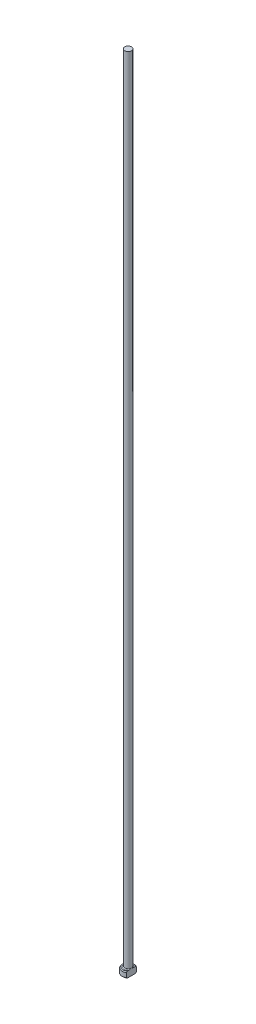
ISO-10303-21;
HEADER;
FILE_DESCRIPTION(('STEP AP214'),'2;1');
FILE_NAME('part.step','',(''),(''),'','','');
FILE_SCHEMA(('AUTOMOTIVE_DESIGN { 1 0 10303 214 1 1 1 1 }'));
ENDSEC;
DATA;
#1=APPLICATION_CONTEXT('core data for automotive mechanical design processes');
#2=APPLICATION_PROTOCOL_DEFINITION('international standard','automotive_design',2000,#1);
#3=PRODUCT_CONTEXT('',#1,'mechanical');
#4=PRODUCT('Part','Part','',(#3));
#5=PRODUCT_RELATED_PRODUCT_CATEGORY('part','',(#4));
#6=PRODUCT_DEFINITION_FORMATION('','',#4);
#7=PRODUCT_DEFINITION_CONTEXT('part definition',#1,'design');
#8=PRODUCT_DEFINITION('design','',#6,#7);
#9=PRODUCT_DEFINITION_SHAPE('','',#8);
#10=(LENGTH_UNIT() NAMED_UNIT(*) SI_UNIT(.MILLI.,.METRE.));
#11=(NAMED_UNIT(*) PLANE_ANGLE_UNIT() SI_UNIT($,.RADIAN.));
#12=(NAMED_UNIT(*) SI_UNIT($,.STERADIAN.) SOLID_ANGLE_UNIT());
#13=UNCERTAINTY_MEASURE_WITH_UNIT(LENGTH_MEASURE(1.E-05),#10,'distance_accuracy_value','');
#14=(GEOMETRIC_REPRESENTATION_CONTEXT(3) GLOBAL_UNCERTAINTY_ASSIGNED_CONTEXT((#13)) GLOBAL_UNIT_ASSIGNED_CONTEXT((#10,
#11,#12)) REPRESENTATION_CONTEXT('',''));
#15=CARTESIAN_POINT('',(0.,0.,0.));
#16=DIRECTION('',(0.,0.,1.));
#17=DIRECTION('',(1.,0.,0.));
#18=AXIS2_PLACEMENT_3D('',#15,#16,#17);
#19=CARTESIAN_POINT('',(0.,0.,0.));
#20=DIRECTION('',(0.,-1.,0.));
#21=DIRECTION('',(0.,0.,-1.));
#22=AXIS2_PLACEMENT_3D('',#19,#20,#21);
#23=PLANE('',#22);
#24=CARTESIAN_POINT('',(0.,0.,0.));
#25=DIRECTION('',(0.,-1.,0.));
#26=DIRECTION('',(0.,0.,-1.));
#27=AXIS2_PLACEMENT_3D('',#24,#25,#26);
#28=CIRCLE('',#27,1.29999999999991);
#29=CARTESIAN_POINT('',(0.849999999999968,0.,0.983615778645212));
#30=VERTEX_POINT('',#29);
#31=CARTESIAN_POINT('',(0.849999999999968,0.,-0.983615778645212));
#32=VERTEX_POINT('',#31);
#33=EDGE_CURVE('E98',#30,#32,#28,.T.);
#34=ORIENTED_EDGE('',*,*,#33,.T.);
#35=DIRECTION('',(0.,0.,1.));
#36=VECTOR('',#35,1.);
#37=CARTESIAN_POINT('',(0.849999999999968,0.,-1.23592070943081));
#38=LINE('',#37,#36);
#39=EDGE_CURVE('E83',#32,#30,#38,.T.);
#40=ORIENTED_EDGE('',*,*,#39,.T.);
#41=EDGE_LOOP('',(#34,#40));
#42=FACE_BOUND('',#41,.T.);
#43=ADVANCED_FACE('F32',(#42),#23,.T.);
#44=CARTESIAN_POINT('',(0.,259.958771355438,0.));
#45=DIRECTION('',(0.,1.,0.));
#46=DIRECTION('',(0.,0.,1.));
#47=AXIS2_PLACEMENT_3D('',#44,#45,#46);
#48=CYLINDRICAL_SURFACE('',#47,1.49999999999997);
#49=CARTESIAN_POINT('',(0.,1.30000000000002,0.));
#50=DIRECTION('',(0.,1.,0.));
#51=DIRECTION('',(0.,0.,1.));
#52=AXIS2_PLACEMENT_3D('',#49,#50,#51);
#53=CIRCLE('',#52,1.49999999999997);
#54=CARTESIAN_POINT('',(0.849999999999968,1.30000000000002,1.23592070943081));
#55=VERTEX_POINT('',#54);
#56=CARTESIAN_POINT('',(0.849999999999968,1.30000000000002,-1.23592070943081));
#57=VERTEX_POINT('',#56);
#58=EDGE_CURVE('E104',#55,#57,#53,.F.);
#59=ORIENTED_EDGE('',*,*,#58,.T.);
#60=DIRECTION('',(0.,-1.,0.));
#61=VECTOR('',#60,1.);
#62=CARTESIAN_POINT('',(0.849999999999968,200.,-1.23592070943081));
#63=LINE('',#62,#61);
#64=CARTESIAN_POINT('',(0.849999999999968,0.200000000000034,-1.23592070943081));
#65=VERTEX_POINT('',#64);
#66=EDGE_CURVE('E183',#57,#65,#63,.T.);
#67=ORIENTED_EDGE('',*,*,#66,.T.);
#68=CARTESIAN_POINT('',(0.,0.200000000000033,0.));
#69=DIRECTION('',(0.,-1.,0.));
#70=DIRECTION('',(0.,0.,-1.));
#71=AXIS2_PLACEMENT_3D('',#68,#69,#70);
#72=CIRCLE('',#71,1.49999999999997);
#73=CARTESIAN_POINT('',(0.849999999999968,0.200000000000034,1.23592070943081));
#74=VERTEX_POINT('',#73);
#75=EDGE_CURVE('E100',#65,#74,#72,.F.);
#76=ORIENTED_EDGE('',*,*,#75,.T.);
#77=DIRECTION('',(0.,-1.,0.));
#78=VECTOR('',#77,1.);
#79=CARTESIAN_POINT('',(0.849999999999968,200.,1.23592070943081));
#80=LINE('',#79,#78);
#81=EDGE_CURVE('E93',#55,#74,#80,.T.);
#82=ORIENTED_EDGE('',*,*,#81,.F.);
#83=EDGE_LOOP('',(#59,#67,#76,#82));
#84=FACE_BOUND('',#83,.T.);
#85=ADVANCED_FACE('F158',(#84),#48,.T.);
#86=CARTESIAN_POINT('',(-1.49999999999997,1.5,0.));
#87=DIRECTION('',(0.,1.,0.));
#88=DIRECTION('',(0.,0.,1.));
#89=AXIS2_PLACEMENT_3D('',#86,#87,#88);
#90=PLANE('',#89);
#91=CARTESIAN_POINT('',(0.,1.5,0.));
#92=DIRECTION('',(0.,1.,0.));
#93=DIRECTION('',(0.,0.,1.));
#94=AXIS2_PLACEMENT_3D('',#91,#92,#93);
#95=CIRCLE('',#94,1.30000000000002);
#96=CARTESIAN_POINT('',(0.849999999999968,1.5,-0.98361577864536));
#97=VERTEX_POINT('',#96);
#98=CARTESIAN_POINT('',(0.849999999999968,1.5,0.98361577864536));
#99=VERTEX_POINT('',#98);
#100=EDGE_CURVE('E178',#97,#99,#95,.T.);
#101=ORIENTED_EDGE('',*,*,#100,.T.);
#102=DIRECTION('',(0.,0.,-1.));
#103=VECTOR('',#102,1.);
#104=CARTESIAN_POINT('',(0.849999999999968,1.5,0.));
#105=LINE('',#104,#103);
#106=CARTESIAN_POINT('',(0.849999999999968,1.49999999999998,0.616441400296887));
#107=VERTEX_POINT('',#106);
#108=EDGE_CURVE('E57',#99,#107,#105,.T.);
#109=ORIENTED_EDGE('',*,*,#108,.T.);
#110=CARTESIAN_POINT('',(0.,1.5,0.));
#111=DIRECTION('',(0.,1.,0.));
#112=DIRECTION('',(0.,0.,1.));
#113=AXIS2_PLACEMENT_3D('',#110,#111,#112);
#114=CIRCLE('',#113,1.04999999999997);
#115=CARTESIAN_POINT('',(0.849999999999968,1.49999999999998,-0.616441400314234));
#116=VERTEX_POINT('',#115);
#117=EDGE_CURVE('E107',#107,#116,#114,.F.);
#118=ORIENTED_EDGE('',*,*,#117,.T.);
#119=EDGE_CURVE('E136',#116,#97,#105,.T.);
#120=ORIENTED_EDGE('',*,*,#119,.T.);
#121=EDGE_LOOP('',(#101,#109,#118,#120));
#122=FACE_BOUND('',#121,.T.);
#123=ADVANCED_FACE('F147',(#122),#90,.T.);
#124=CARTESIAN_POINT('',(0.,1.5,0.));
#125=DIRECTION('',(0.,-1.,0.));
#126=DIRECTION('',(0.,0.,-1.));
#127=AXIS2_PLACEMENT_3D('',#124,#125,#126);
#128=CONICAL_SURFACE('',#127,1.30000000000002,0.785398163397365);
#129=ORIENTED_EDGE('',*,*,#58,.F.);
#130=CARTESIAN_POINT('',(0.849999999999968,-0.0536064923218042,2.72407232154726));
#131=CARTESIAN_POINT('',(0.849999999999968,0.039914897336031,2.62606654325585));
#132=CARTESIAN_POINT('',(0.849999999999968,0.133238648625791,2.52786853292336));
#133=CARTESIAN_POINT('',(0.849999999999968,0.31925113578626,2.33082073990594));
#134=CARTESIAN_POINT('',(0.849999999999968,0.411939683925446,2.23197078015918));
#135=CARTESIAN_POINT('',(0.849999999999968,0.597160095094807,2.03257664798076));
#136=CARTESIAN_POINT('',(0.849999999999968,0.689684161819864,1.93202522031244));
#137=CARTESIAN_POINT('',(0.849999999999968,0.873277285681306,1.72962471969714));
#138=CARTESIAN_POINT('',(0.849999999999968,0.964346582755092,1.62777586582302));
#139=CARTESIAN_POINT('',(0.849999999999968,1.10955880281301,1.46151679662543));
#140=CARTESIAN_POINT('',(0.849999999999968,1.16444529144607,1.39775756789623));
#141=CARTESIAN_POINT('',(0.849999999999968,1.27292840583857,1.26911422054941));
#142=CARTESIAN_POINT('',(0.849999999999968,1.32652466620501,1.20422979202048));
#143=CARTESIAN_POINT('',(0.849999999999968,1.43166568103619,1.07302339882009));
#144=CARTESIAN_POINT('',(0.849999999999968,1.48321432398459,1.00670456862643));
#145=CARTESIAN_POINT('',(0.849999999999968,1.58324559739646,0.87181221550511));
#146=CARTESIAN_POINT('',(0.849999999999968,1.63173001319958,0.803240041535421));
#147=CARTESIAN_POINT('',(0.849999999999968,1.71576170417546,0.674554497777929));
#148=CARTESIAN_POINT('',(0.849999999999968,1.75211002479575,0.614972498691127));
#149=CARTESIAN_POINT('',(0.849999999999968,1.81898270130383,0.492486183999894));
#150=CARTESIAN_POINT('',(0.849999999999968,1.84950605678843,0.42958130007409));
#151=CARTESIAN_POINT('',(0.849999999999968,1.89525543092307,0.313443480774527));
#152=CARTESIAN_POINT('',(0.849999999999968,1.91235250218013,0.260986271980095));
#153=CARTESIAN_POINT('',(0.849999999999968,1.93136611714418,0.180826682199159));
#154=CARTESIAN_POINT('',(0.849999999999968,1.93659539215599,0.153907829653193));
#155=CARTESIAN_POINT('',(0.849999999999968,1.94459007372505,0.099712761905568));
#156=CARTESIAN_POINT('',(0.849999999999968,1.94735676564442,0.0724367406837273));
#157=CARTESIAN_POINT('',(0.849999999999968,1.95026529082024,0.0175115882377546));
#158=CARTESIAN_POINT('',(0.849999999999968,1.95038485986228,-0.0101387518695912));
#159=CARTESIAN_POINT('',(0.849999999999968,1.94794150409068,-0.0653143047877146));
#160=CARTESIAN_POINT('',(0.849999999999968,1.94537851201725,-0.0928395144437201));
#161=CARTESIAN_POINT('',(0.849999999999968,1.93385723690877,-0.17503084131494));
#162=CARTESIAN_POINT('',(0.849999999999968,1.92106065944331,-0.229178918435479));
#163=CARTESIAN_POINT('',(0.849999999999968,1.89152127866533,-0.323067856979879));
#164=CARTESIAN_POINT('',(0.849999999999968,1.87629794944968,-0.363325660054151));
#165=CARTESIAN_POINT('',(0.849999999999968,1.84242832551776,-0.44239812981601));
#166=CARTESIAN_POINT('',(0.849999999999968,1.82377936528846,-0.481211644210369));
#167=CARTESIAN_POINT('',(0.849999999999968,1.78377495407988,-0.557941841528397));
#168=CARTESIAN_POINT('',(0.849999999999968,1.76239176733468,-0.595843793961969));
#169=CARTESIAN_POINT('',(0.849999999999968,1.71778219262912,-0.670514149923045));
#170=CARTESIAN_POINT('',(0.849999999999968,1.69455659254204,-0.707283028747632));
#171=CARTESIAN_POINT('',(0.849999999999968,1.63863584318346,-0.792218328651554));
#172=CARTESIAN_POINT('',(0.849999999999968,1.60539843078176,-0.840025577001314));
#173=CARTESIAN_POINT('',(0.849999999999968,1.53723101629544,-0.93442364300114));
#174=CARTESIAN_POINT('',(0.849999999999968,1.50230057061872,-0.98101413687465));
#175=CARTESIAN_POINT('',(0.849999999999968,1.43120159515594,-1.07330100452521));
#176=CARTESIAN_POINT('',(0.849999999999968,1.39503201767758,-1.11899656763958));
#177=CARTESIAN_POINT('',(0.849999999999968,1.32179772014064,-1.20966630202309));
#178=CARTESIAN_POINT('',(0.849999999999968,1.2847329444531,-1.25464042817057));
#179=CARTESIAN_POINT('',(0.849999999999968,1.17226420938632,-1.38904939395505));
#180=CARTESIAN_POINT('',(0.849999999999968,1.09584896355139,-1.47763652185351));
#181=CARTESIAN_POINT('',(0.849999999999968,0.941436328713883,-1.6533275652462));
#182=CARTESIAN_POINT('',(0.849999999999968,0.863439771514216,-1.74043221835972));
#183=CARTESIAN_POINT('',(0.849999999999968,0.715932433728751,-1.90311943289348));
#184=CARTESIAN_POINT('',(0.849999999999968,0.646544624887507,-1.97881368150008));
#185=CARTESIAN_POINT('',(0.849999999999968,0.507159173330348,-2.12965926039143));
#186=CARTESIAN_POINT('',(0.849999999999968,0.437161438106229,-2.20481050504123));
#187=CARTESIAN_POINT('',(0.849999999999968,0.29721774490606,-2.35416590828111));
#188=CARTESIAN_POINT('',(0.849999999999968,0.227274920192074,-2.42837300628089));
#189=CARTESIAN_POINT('',(0.849999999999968,0.0870600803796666,-2.57645011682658));
#190=CARTESIAN_POINT('',(0.849999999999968,0.0167881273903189,-2.65032018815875));
#191=CARTESIAN_POINT('',(0.849999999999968,-0.0536064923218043,-2.72407232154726));
#192=B_SPLINE_CURVE_WITH_KNOTS('',3,(#130,#131,#132,#133,#134,#135,#136,#137,#138,#139,#140,
#141,#142,#143,#144,#145,#146,#147,#148,#149,#150,#151,#152,#153,#154,#155,#156,#157,#158,#159,
#160,#161,#162,#163,#164,#165,#166,#167,#168,#169,#170,#171,#172,#173,#174,#175,#176,#177,#178,
#179,#180,#181,#182,#183,#184,#185,#186,#187,#188,#189,#190,#191),.UNSPECIFIED.,.F.,.F.,(4,2,2,
2,2,2,2,2,2,2,2,2,2,2,2,2,2,2,2,2,2,2,2,2,2,2,2,2,2,2,4),(0.,0.406405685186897,
0.812926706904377,1.22284825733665,1.63270148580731,1.88507867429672,2.13752651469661,
2.3894694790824,2.64126427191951,2.8504643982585,3.05970042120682,3.22459093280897,
3.30675945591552,3.38888506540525,3.47170115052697,3.55451931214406,3.72055062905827,
3.84950358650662,3.97855731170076,4.10904305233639,4.23947329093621,4.4140945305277,
4.58876177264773,4.76358052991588,4.93841017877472,5.28934513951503,5.64010005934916,
5.94815166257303,6.25625083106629,6.56217157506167,6.86803674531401),.UNSPECIFIED.);
#193=EDGE_CURVE('E135',#55,#99,#192,.T.);
#194=ORIENTED_EDGE('',*,*,#193,.T.);
#195=ORIENTED_EDGE('',*,*,#100,.F.);
#196=EDGE_CURVE('E127',#97,#57,#192,.T.);
#197=ORIENTED_EDGE('',*,*,#196,.T.);
#198=EDGE_LOOP('',(#129,#194,#195,#197));
#199=FACE_BOUND('',#198,.T.);
#200=ADVANCED_FACE('F143',(#199),#128,.T.);
#201=CARTESIAN_POINT('',(0.,0.200000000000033,0.));
#202=DIRECTION('',(0.,1.,0.));
#203=DIRECTION('',(0.,0.,1.));
#204=AXIS2_PLACEMENT_3D('',#201,#202,#203);
#205=CONICAL_SURFACE('',#204,1.49999999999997,0.785398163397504);
#206=ORIENTED_EDGE('',*,*,#75,.F.);
#207=CARTESIAN_POINT('',(0.849999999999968,1.55360649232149,-2.72407232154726));
#208=CARTESIAN_POINT('',(0.849999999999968,1.46008510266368,-2.62606654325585));
#209=CARTESIAN_POINT('',(0.849999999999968,1.36676135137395,-2.52786853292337));
#210=CARTESIAN_POINT('',(0.849999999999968,1.18074886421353,-2.33082073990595));
#211=CARTESIAN_POINT('',(0.849999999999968,1.08806031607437,-2.23197078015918));
#212=CARTESIAN_POINT('',(0.849999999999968,0.902839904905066,-2.03257664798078));
#213=CARTESIAN_POINT('',(0.849999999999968,0.810315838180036,-1.93202522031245));
#214=CARTESIAN_POINT('',(0.849999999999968,0.626722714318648,-1.72962471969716));
#215=CARTESIAN_POINT('',(0.849999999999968,0.535653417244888,-1.62777586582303));
#216=CARTESIAN_POINT('',(0.849999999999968,0.390441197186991,-1.46151679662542));
#217=CARTESIAN_POINT('',(0.849999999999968,0.33555470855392,-1.3977575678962));
#218=CARTESIAN_POINT('',(0.849999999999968,0.227071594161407,-1.26911422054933));
#219=CARTESIAN_POINT('',(0.849999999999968,0.17347533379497,-1.20422979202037));
#220=CARTESIAN_POINT('',(0.849999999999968,0.0683343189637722,-1.07302339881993));
#221=CARTESIAN_POINT('',(0.849999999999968,0.0167856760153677,-1.00670456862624));
#222=CARTESIAN_POINT('',(0.849999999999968,-0.0832455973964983,-0.871812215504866));
#223=CARTESIAN_POINT('',(0.849999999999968,-0.131730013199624,-0.803240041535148));
#224=CARTESIAN_POINT('',(0.849999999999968,-0.215761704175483,-0.674554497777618));
#225=CARTESIAN_POINT('',(0.849999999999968,-0.252110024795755,-0.614972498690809));
#226=CARTESIAN_POINT('',(0.849999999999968,-0.318982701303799,-0.492486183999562));
#227=CARTESIAN_POINT('',(0.849999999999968,-0.349506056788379,-0.42958130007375));
#228=CARTESIAN_POINT('',(0.849999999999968,-0.395255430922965,-0.313443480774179));
#229=CARTESIAN_POINT('',(0.849999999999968,-0.412352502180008,-0.260986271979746));
#230=CARTESIAN_POINT('',(0.849999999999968,-0.431366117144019,-0.180826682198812));
#231=CARTESIAN_POINT('',(0.849999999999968,-0.436595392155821,-0.153907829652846));
#232=CARTESIAN_POINT('',(0.849999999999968,-0.444590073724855,-0.0997127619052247));
#233=CARTESIAN_POINT('',(0.849999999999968,-0.447356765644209,-0.072436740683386));
#234=CARTESIAN_POINT('',(0.849999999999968,-0.450265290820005,-0.0175115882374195));
#235=CARTESIAN_POINT('',(0.849999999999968,-0.450384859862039,0.0101387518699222));
#236=CARTESIAN_POINT('',(0.849999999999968,-0.44794150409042,0.0653143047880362));
#237=CARTESIAN_POINT('',(0.849999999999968,-0.445378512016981,0.0928395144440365));
#238=CARTESIAN_POINT('',(0.849999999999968,-0.433857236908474,0.175030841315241));
#239=CARTESIAN_POINT('',(0.849999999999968,-0.421060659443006,0.229178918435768));
#240=CARTESIAN_POINT('',(0.849999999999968,-0.391521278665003,0.323067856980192));
#241=CARTESIAN_POINT('',(0.849999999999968,-0.37629794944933,0.363325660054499));
#242=CARTESIAN_POINT('',(0.849999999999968,-0.342428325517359,0.442398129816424));
#243=CARTESIAN_POINT('',(0.849999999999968,-0.323779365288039,0.481211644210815));
#244=CARTESIAN_POINT('',(0.849999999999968,-0.283774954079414,0.557941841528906));
#245=CARTESIAN_POINT('',(0.849999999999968,-0.262391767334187,0.595843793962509));
#246=CARTESIAN_POINT('',(0.849999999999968,-0.217782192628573,0.670514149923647));
#247=CARTESIAN_POINT('',(0.849999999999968,-0.194556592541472,0.707283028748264));
#248=CARTESIAN_POINT('',(0.849999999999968,-0.138635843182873,0.792218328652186));
#249=CARTESIAN_POINT('',(0.849999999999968,-0.105398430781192,0.840025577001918));
#250=CARTESIAN_POINT('',(0.849999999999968,-0.0372310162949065,0.934423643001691));
#251=CARTESIAN_POINT('',(0.849999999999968,-0.00230057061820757,0.981014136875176));
#252=CARTESIAN_POINT('',(0.849999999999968,0.0687984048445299,1.07330100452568));
#253=CARTESIAN_POINT('',(0.849999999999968,0.104967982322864,1.11899656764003));
#254=CARTESIAN_POINT('',(0.849999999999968,0.178202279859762,1.2096663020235));
#255=CARTESIAN_POINT('',(0.849999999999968,0.215267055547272,1.25464042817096));
#256=CARTESIAN_POINT('',(0.849999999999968,0.327735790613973,1.38904939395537));
#257=CARTESIAN_POINT('',(0.849999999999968,0.404151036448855,1.47763652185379));
#258=CARTESIAN_POINT('',(0.849999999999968,0.558563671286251,1.6533275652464));
#259=CARTESIAN_POINT('',(0.849999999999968,0.636560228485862,1.74043221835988));
#260=CARTESIAN_POINT('',(0.849999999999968,0.784067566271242,1.90311943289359));
#261=CARTESIAN_POINT('',(0.849999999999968,0.853455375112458,1.97881368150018));
#262=CARTESIAN_POINT('',(0.849999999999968,0.992840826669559,2.12965926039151));
#263=CARTESIAN_POINT('',(0.849999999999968,1.06283856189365,2.20481050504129));
#264=CARTESIAN_POINT('',(0.849999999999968,1.20278225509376,2.35416590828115));
#265=CARTESIAN_POINT('',(0.849999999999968,1.27272507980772,2.42837300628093));
#266=CARTESIAN_POINT('',(0.849999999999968,1.41293991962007,2.5764501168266));
#267=CARTESIAN_POINT('',(0.849999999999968,1.48321187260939,2.65032018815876));
#268=CARTESIAN_POINT('',(0.849999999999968,1.55360649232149,2.72407232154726));
#269=B_SPLINE_CURVE_WITH_KNOTS('',3,(#207,#208,#209,#210,#211,#212,#213,#214,#215,#216,#217,
#218,#219,#220,#221,#222,#223,#224,#225,#226,#227,#228,#229,#230,#231,#232,#233,#234,#235,#236,
#237,#238,#239,#240,#241,#242,#243,#244,#245,#246,#247,#248,#249,#250,#251,#252,#253,#254,#255,
#256,#257,#258,#259,#260,#261,#262,#263,#264,#265,#266,#267,#268),.UNSPECIFIED.,.F.,.F.,(4,2,2,
2,2,2,2,2,2,2,2,2,2,2,2,2,2,2,2,2,2,2,2,2,2,2,2,2,2,2,4),(0.,0.406405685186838,
0.812926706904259,1.22284825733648,1.63270148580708,1.88507867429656,2.13752651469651,
2.38946947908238,2.64126427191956,2.85046439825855,3.05970042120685,3.22459093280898,
3.30675945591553,3.38888506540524,3.47170115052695,3.55451931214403,3.72055062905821,
3.84950358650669,3.97855731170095,4.10904305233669,4.23947329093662,4.41409453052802,
4.58876177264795,4.76358052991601,4.93841017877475,5.28934513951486,5.64010005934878,
5.94815166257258,6.25625083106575,6.56217157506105,6.86803674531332),.UNSPECIFIED.);
#270=EDGE_CURVE('E86',#65,#32,#269,.T.);
#271=ORIENTED_EDGE('',*,*,#270,.T.);
#272=ORIENTED_EDGE('',*,*,#33,.F.);
#273=EDGE_CURVE('E89',#30,#74,#269,.T.);
#274=ORIENTED_EDGE('',*,*,#273,.T.);
#275=EDGE_LOOP('',(#206,#271,#272,#274));
#276=FACE_BOUND('',#275,.T.);
#277=ADVANCED_FACE('F97',(#276),#205,.T.);
#278=CARTESIAN_POINT('',(0.,1.69999999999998,0.));
#279=DIRECTION('',(0.,1.,0.));
#280=DIRECTION('',(0.,0.,1.));
#281=AXIS2_PLACEMENT_3D('',#278,#279,#280);
#282=TOROIDAL_SURFACE('',#281,1.04999999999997,0.2);
#283=CARTESIAN_POINT('',(0.849999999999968,1.69999999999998,0.));
#284=CARTESIAN_POINT('',(0.849999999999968,1.70000051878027,-9.40181058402E-12));
#285=CARTESIAN_POINT('',(0.849999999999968,1.70000103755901,-8.53981725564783E-08));
#286=CARTESIAN_POINT('',(0.849999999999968,1.70000204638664,-3.68295676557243E-07));
#287=CARTESIAN_POINT('',(0.849999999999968,1.70000253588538,-5.67473109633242E-07));
#288=CARTESIAN_POINT('',(0.849999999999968,1.70000350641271,-1.05059094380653E-06));
#289=CARTESIAN_POINT('',(0.849999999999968,1.70000398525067,-1.33882692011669E-06));
#290=CARTESIAN_POINT('',(0.849999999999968,1.7000049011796,-1.96944630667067E-06));
#291=CARTESIAN_POINT('',(0.849999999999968,1.70000533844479,-2.31158620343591E-06));
#292=CARTESIAN_POINT('',(0.849999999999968,1.70000675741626,-3.51016254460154E-06));
#293=CARTESIAN_POINT('',(0.849999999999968,1.70000767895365,-4.43847621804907E-06));
#294=CARTESIAN_POINT('',(0.849999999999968,1.70000936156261,-6.38697155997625E-06));
#295=CARTESIAN_POINT('',(0.849999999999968,1.7000101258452,-7.40454028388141E-06));
#296=CARTESIAN_POINT('',(0.849999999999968,1.70001287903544,-1.12525915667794E-05));
#297=CARTESIAN_POINT('',(0.849999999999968,1.70001471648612,-1.41948048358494E-05));
#298=CARTESIAN_POINT('',(0.849999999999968,1.70001783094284,-2.00941117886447E-05));
#299=CARTESIAN_POINT('',(0.849999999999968,1.7000191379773,-2.30360250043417E-05));
#300=CARTESIAN_POINT('',(0.849999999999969,1.700024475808,-3.52043664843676E-05));
#301=CARTESIAN_POINT('',(0.849999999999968,1.70002838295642,-4.4479803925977E-05));
#302=CARTESIAN_POINT('',(0.849999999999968,1.70003486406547,-6.20583674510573E-05));
#303=CARTESIAN_POINT('',(0.849999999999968,1.70003754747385,-7.03197985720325E-05));
#304=CARTESIAN_POINT('',(0.849999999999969,1.70005819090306,-0.000128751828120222));
#305=CARTESIAN_POINT('',(0.849999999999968,1.70008371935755,-0.000175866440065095));
#306=CARTESIAN_POINT('',(0.849999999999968,1.70017804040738,-0.000356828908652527));
#307=CARTESIAN_POINT('',(0.849999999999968,1.70024121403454,-0.000492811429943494));
#308=CARTESIAN_POINT('',(0.849999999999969,1.70048655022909,-0.00101279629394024));
#309=CARTESIAN_POINT('',(0.849999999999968,1.70067459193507,-0.0013945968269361));
#310=CARTESIAN_POINT('',(0.849999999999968,1.7014276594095,-0.00293145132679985));
#311=CARTESIAN_POINT('',(0.849999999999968,1.70198609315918,-0.0040889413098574));
#312=CARTESIAN_POINT('',(0.849999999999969,1.71043533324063,-0.0215925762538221));
#313=CARTESIAN_POINT('',(0.849999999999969,1.71837727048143,-0.0379203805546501));
#314=CARTESIAN_POINT('',(0.849999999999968,1.7338686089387,-0.0700737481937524));
#315=CARTESIAN_POINT('',(0.849999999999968,1.74142215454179,-0.0858974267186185));
#316=CARTESIAN_POINT('',(0.849999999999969,1.75718253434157,-0.119339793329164));
#317=CARTESIAN_POINT('',(0.849999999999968,1.76537140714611,-0.136967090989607));
#318=CARTESIAN_POINT('',(0.849999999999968,1.78150993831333,-0.172531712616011));
#319=CARTESIAN_POINT('',(0.849999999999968,1.78945661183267,-0.190470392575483));
#320=CARTESIAN_POINT('',(0.849999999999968,1.80890508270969,-0.23585761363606));
#321=CARTESIAN_POINT('',(0.849999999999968,1.8201219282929,-0.263430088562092));
#322=CARTESIAN_POINT('',(0.849999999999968,1.84085119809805,-0.31855841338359));
#323=CARTESIAN_POINT('',(0.849999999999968,1.85039454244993,-0.346102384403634));
#324=CARTESIAN_POINT('',(0.849999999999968,1.86376741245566,-0.389594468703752));
#325=CARTESIAN_POINT('',(0.849999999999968,1.86826823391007,-0.405334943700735));
#326=CARTESIAN_POINT('',(0.849999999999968,1.87655535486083,-0.437077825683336));
#327=CARTESIAN_POINT('',(0.849999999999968,1.8803382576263,-0.453081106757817));
#328=CARTESIAN_POINT('',(0.849999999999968,1.8907100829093,-0.502906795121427));
#329=CARTESIAN_POINT('',(0.849999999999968,1.89584064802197,-0.537068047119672));
#330=CARTESIAN_POINT('',(0.849999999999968,1.90023986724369,-0.59774723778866));
#331=CARTESIAN_POINT('',(0.849999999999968,1.90059986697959,-0.624181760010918));
#332=CARTESIAN_POINT('',(0.849999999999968,1.89734237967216,-0.676523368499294));
#333=CARTESIAN_POINT('',(0.849999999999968,1.89377863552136,-0.702432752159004));
#334=CARTESIAN_POINT('',(0.849999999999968,1.88404638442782,-0.743149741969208));
#335=CARTESIAN_POINT('',(0.849999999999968,1.87944517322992,-0.758330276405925));
#336=CARTESIAN_POINT('',(0.849999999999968,1.86810073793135,-0.787921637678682));
#337=CARTESIAN_POINT('',(0.849999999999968,1.86135499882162,-0.802331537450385));
#338=CARTESIAN_POINT('',(0.849999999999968,1.84721190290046,-0.826746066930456));
#339=CARTESIAN_POINT('',(0.849999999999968,1.84028561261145,-0.837021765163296));
#340=CARTESIAN_POINT('',(0.849999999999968,1.82488560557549,-0.856339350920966));
#341=CARTESIAN_POINT('',(0.849999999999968,1.8164148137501,-0.86538351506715));
#342=CARTESIAN_POINT('',(0.849999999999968,1.79993436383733,-0.879978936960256));
#343=CARTESIAN_POINT('',(0.849999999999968,1.79222027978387,-0.885862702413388));
#344=CARTESIAN_POINT('',(0.849999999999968,1.77592760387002,-0.896293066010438));
#345=CARTESIAN_POINT('',(0.849999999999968,1.76734935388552,-0.900840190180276));
#346=CARTESIAN_POINT('',(0.849999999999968,1.74943887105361,-0.908347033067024));
#347=CARTESIAN_POINT('',(0.849999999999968,1.74010143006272,-0.911294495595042));
#348=CARTESIAN_POINT('',(0.849999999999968,1.7210315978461,-0.91532157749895));
#349=CARTESIAN_POINT('',(0.849999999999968,1.71129950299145,-0.916402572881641));
#350=CARTESIAN_POINT('',(0.849999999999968,1.69303591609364,-0.916598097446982));
#351=CARTESIAN_POINT('',(0.849999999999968,1.68450611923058,-0.915941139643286));
#352=CARTESIAN_POINT('',(0.849999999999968,1.667687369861,-0.913176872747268));
#353=CARTESIAN_POINT('',(0.849999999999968,1.65939839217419,-0.911069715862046));
#354=CARTESIAN_POINT('',(0.849999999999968,1.64340816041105,-0.905576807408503));
#355=CARTESIAN_POINT('',(0.849999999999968,1.63569966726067,-0.902211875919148));
#356=CARTESIAN_POINT('',(0.849999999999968,1.62087356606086,-0.894372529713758));
#357=CARTESIAN_POINT('',(0.849999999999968,1.61375616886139,-0.889897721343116));
#358=CARTESIAN_POINT('',(0.849999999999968,1.59761508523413,-0.87813790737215));
#359=CARTESIAN_POINT('',(0.849999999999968,1.58889769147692,-0.870431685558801));
#360=CARTESIAN_POINT('',(0.849999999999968,1.5728293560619,-0.853701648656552));
#361=CARTESIAN_POINT('',(0.849999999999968,1.56548157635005,-0.84467486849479));
#362=CARTESIAN_POINT('',(0.849999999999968,1.54959009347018,-0.822072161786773));
#363=CARTESIAN_POINT('',(0.849999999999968,1.5416531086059,-0.808071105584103));
#364=CARTESIAN_POINT('',(0.849999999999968,1.52810899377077,-0.77903495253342));
#365=CARTESIAN_POINT('',(0.849999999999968,1.52250055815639,-0.764000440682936));
#366=CARTESIAN_POINT('',(0.849999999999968,1.51092301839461,-0.725431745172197));
#367=CARTESIAN_POINT('',(0.849999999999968,1.50625689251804,-0.7015093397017));
#368=CARTESIAN_POINT('',(0.849999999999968,1.50057784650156,-0.65298680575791));
#369=CARTESIAN_POINT('',(0.849999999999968,1.49961383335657,-0.628381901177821));
#370=CARTESIAN_POINT('',(0.849999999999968,1.50106390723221,-0.560102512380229));
#371=CARTESIAN_POINT('',(0.849999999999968,1.50669397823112,-0.516501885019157));
#372=CARTESIAN_POINT('',(0.849999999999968,1.51953102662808,-0.453258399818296));
#373=CARTESIAN_POINT('',(0.849999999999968,1.52436540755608,-0.433034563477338));
#374=CARTESIAN_POINT('',(0.849999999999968,1.53515534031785,-0.393001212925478));
#375=CARTESIAN_POINT('',(0.849999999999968,1.54110441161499,-0.373190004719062));
#376=CARTESIAN_POINT('',(0.849999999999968,1.55603600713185,-0.327373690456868));
#377=CARTESIAN_POINT('',(0.849999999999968,1.56537124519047,-0.301485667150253));
#378=CARTESIAN_POINT('',(0.849999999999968,1.58544986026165,-0.249610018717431));
#379=CARTESIAN_POINT('',(0.849999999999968,1.59621976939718,-0.2236328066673));
#380=CARTESIAN_POINT('',(0.849999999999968,1.61482171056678,-0.180777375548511));
#381=CARTESIAN_POINT('',(0.849999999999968,1.62241504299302,-0.163793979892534));
#382=CARTESIAN_POINT('',(0.849999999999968,1.63780310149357,-0.130109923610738));
#383=CARTESIAN_POINT('',(0.849999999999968,1.64559528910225,-0.113408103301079));
#384=CARTESIAN_POINT('',(0.849999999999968,1.66057370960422,-0.0817127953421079));
#385=CARTESIAN_POINT('',(0.849999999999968,1.66774468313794,-0.0667119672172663));
#386=CARTESIAN_POINT('',(0.849999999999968,1.68244267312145,-0.0362276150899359));
#387=CARTESIAN_POINT('',(0.849999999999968,1.68997332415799,-0.020745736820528));
#388=CARTESIAN_POINT('',(0.849999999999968,1.69801386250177,-0.00408905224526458));
#389=CARTESIAN_POINT('',(0.849999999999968,1.69857223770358,-0.00293166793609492));
#390=CARTESIAN_POINT('',(0.849999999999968,1.69932528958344,-0.00139484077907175));
#391=CARTESIAN_POINT('',(0.849999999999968,1.69951337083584,-0.00101296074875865));
#392=CARTESIAN_POINT('',(0.849999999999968,1.69975875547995,-0.000492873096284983));
#393=CARTESIAN_POINT('',(0.849999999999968,1.69982193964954,-0.000356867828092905));
#394=CARTESIAN_POINT('',(0.849999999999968,1.6999162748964,-0.000175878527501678));
#395=CARTESIAN_POINT('',(0.849999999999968,1.6999418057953,-0.000128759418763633));
#396=CARTESIAN_POINT('',(0.849999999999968,1.69996245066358,-7.03220999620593E-05));
#397=CARTESIAN_POINT('',(0.849999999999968,1.69996513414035,-6.20602802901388E-05));
#398=CARTESIAN_POINT('',(0.849999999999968,1.69997161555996,-4.44808855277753E-05));
#399=CARTESIAN_POINT('',(0.849999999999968,1.69997552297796,-3.52050155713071E-05));
#400=CARTESIAN_POINT('',(0.849999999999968,1.6999808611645,-2.30361869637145E-05));
#401=CARTESIAN_POINT('',(0.849999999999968,1.69998216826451,-2.00942075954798E-05));
#402=CARTESIAN_POINT('',(0.849999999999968,1.69998528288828,-1.41947798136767E-05));
#403=CARTESIAN_POINT('',(0.849999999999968,1.69998712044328,-1.12525137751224E-05));
#404=CARTESIAN_POINT('',(0.849999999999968,1.6999898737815,-7.40441477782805E-06));
#405=CARTESIAN_POINT('',(0.849999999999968,1.69999063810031,-6.38684057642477E-06));
#406=CARTESIAN_POINT('',(0.849999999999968,1.69999232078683,-4.4383417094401E-06));
#407=CARTESIAN_POINT('',(0.849999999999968,1.69999324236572,-3.51003022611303E-06));
#408=CARTESIAN_POINT('',(0.849999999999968,1.69999466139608,-2.3114658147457E-06));
#409=CARTESIAN_POINT('',(0.849999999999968,1.69999509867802,-1.96933111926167E-06));
#410=CARTESIAN_POINT('',(0.849999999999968,1.69999601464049,-1.338725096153E-06));
#411=CARTESIAN_POINT('',(0.849999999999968,1.69999649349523,-1.05049730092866E-06));
#412=CARTESIAN_POINT('',(0.849999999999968,1.69999746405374,-5.67399370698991E-07));
#413=CARTESIAN_POINT('',(0.849999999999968,1.69999795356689,-3.68233376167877E-07));
#414=CARTESIAN_POINT('',(0.849999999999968,1.69999896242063,-8.53633970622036E-08));
#415=CARTESIAN_POINT('',(0.849999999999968,1.69999948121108,9.40196651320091E-12));
#416=CARTESIAN_POINT('',(0.849999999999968,1.69999999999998,0.));
#417=B_SPLINE_CURVE_WITH_KNOTS('',3,(#283,#284,#285,#286,#287,#288,#289,#290,#291,#292,#293,
#294,#295,#296,#297,#298,#299,#300,#301,#302,#303,#304,#305,#306,#307,#308,#309,#310,#311,#312,
#313,#314,#315,#316,#317,#318,#319,#320,#321,#322,#323,#324,#325,#326,#327,#328,#329,#330,#331,
#332,#333,#334,#335,#336,#337,#338,#339,#340,#341,#342,#343,#344,#345,#346,#347,#348,#349,#350,
#351,#352,#353,#354,#355,#356,#357,#358,#359,#360,#361,#362,#363,#364,#365,#366,#367,#368,#369,
#370,#371,#372,#373,#374,#375,#376,#377,#378,#379,#380,#381,#382,#383,#384,#385,#386,#387,#388,
#389,#390,#391,#392,#393,#394,#395,#396,#397,#398,#399,#400,#401,#402,#403,#404,#405,#406,#407,
#408,#409,#410,#411,#412,#413,#414,#415,#416),.UNSPECIFIED.,.T.,.F.,(4,2,2,2,2,2,2,2,2,2,2,2,2,
2,2,2,2,2,2,2,2,2,2,2,2,2,2,2,2,2,2,2,2,2,2,2,2,2,2,2,2,2,2,2,2,2,2,2,2,2,2,2,2,2,2,2,2,2,2,2,2,
2,2,2,2,2,4),(0.,1.55468737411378E-06,3.13278180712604E-06,4.80367222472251E-06,
6.46722002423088E-06,1.03719688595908E-05,1.41866502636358E-05,2.45537684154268E-05,
3.42019719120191E-05,6.43851505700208E-05,9.04176825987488E-05,0.000250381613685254,
0.00070083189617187,0.00197684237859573,0.0058331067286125,0.060296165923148,0.112899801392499,
0.171206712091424,0.230063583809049,0.319335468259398,0.406727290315,0.455824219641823,
0.505147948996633,0.608437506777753,0.687539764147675,0.765571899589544,0.81303553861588,
0.860555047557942,0.897604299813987,0.934584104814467,0.96357666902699,0.992557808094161,
1.02175796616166,1.05093658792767,1.0764748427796,1.10201041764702,1.12714077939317,
1.15228006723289,1.18699327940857,1.2217856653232,1.26980034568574,1.31778806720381,
1.39050031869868,1.4641699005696,1.59521965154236,1.65759205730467,1.71961250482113,
1.80213235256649,1.8864735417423,1.94228209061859,1.99757019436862,2.047451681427,
2.09909333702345,2.10294924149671,2.10422551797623,2.10467604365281,2.10483602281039,
2.10486205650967,2.10489224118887,2.10490188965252,2.10491225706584,2.10491607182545,
2.10491997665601,2.10492164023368,2.10492331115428,2.10492488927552,2.10492644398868),.UNSPECIFIED.);
#418=CARTESIAN_POINT('',(0.849999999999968,1.69999999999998,0.));
#419=VERTEX_POINT('',#418);
#420=EDGE_CURVE('E11',#116,#419,#417,.T.);
#421=ORIENTED_EDGE('',*,*,#420,.F.);
#422=ORIENTED_EDGE('',*,*,#117,.F.);
#423=CARTESIAN_POINT('',(0.849999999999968,1.69999999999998,0.));
#424=CARTESIAN_POINT('',(0.849999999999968,1.69999948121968,9.40181404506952E-12));
#425=CARTESIAN_POINT('',(0.849999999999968,1.69999896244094,8.53981725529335E-08));
#426=CARTESIAN_POINT('',(0.849999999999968,1.69999795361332,3.68295676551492E-07));
#427=CARTESIAN_POINT('',(0.849999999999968,1.69999746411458,5.67473109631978E-07));
#428=CARTESIAN_POINT('',(0.849999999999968,1.69999649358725,1.05059094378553E-06));
#429=CARTESIAN_POINT('',(0.849999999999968,1.69999601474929,1.33882692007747E-06));
#430=CARTESIAN_POINT('',(0.849999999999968,1.69999509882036,1.96944630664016E-06));
#431=CARTESIAN_POINT('',(0.849999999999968,1.69999466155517,2.31158620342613E-06));
#432=CARTESIAN_POINT('',(0.849999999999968,1.6999932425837,3.51016254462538E-06));
#433=CARTESIAN_POINT('',(0.849999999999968,1.6999923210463,4.43847621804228E-06));
#434=CARTESIAN_POINT('',(0.849999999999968,1.69999063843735,6.38697155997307E-06));
#435=CARTESIAN_POINT('',(0.849999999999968,1.69998987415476,7.4045402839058E-06));
#436=CARTESIAN_POINT('',(0.849999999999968,1.69998712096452,1.12525915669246E-05));
#437=CARTESIAN_POINT('',(0.849999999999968,1.69998528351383,1.41948048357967E-05));
#438=CARTESIAN_POINT('',(0.849999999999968,1.69998216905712,2.0094111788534E-05));
#439=CARTESIAN_POINT('',(0.849999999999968,1.69998086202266,2.30360250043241E-05));
#440=CARTESIAN_POINT('',(0.849999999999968,1.69997552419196,3.52043664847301E-05));
#441=CARTESIAN_POINT('',(0.849999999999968,1.69997161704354,4.44798039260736E-05));
#442=CARTESIAN_POINT('',(0.849999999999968,1.69996513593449,6.20583674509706E-05));
#443=CARTESIAN_POINT('',(0.849999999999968,1.69996245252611,7.03197985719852E-05));
#444=CARTESIAN_POINT('',(0.849999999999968,1.6999418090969,0.000128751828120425));
#445=CARTESIAN_POINT('',(0.849999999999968,1.69991628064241,0.000175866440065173));
#446=CARTESIAN_POINT('',(0.849999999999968,1.69982195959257,0.000356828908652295));
#447=CARTESIAN_POINT('',(0.849999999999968,1.69975878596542,0.000492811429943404));
#448=CARTESIAN_POINT('',(0.849999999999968,1.69951344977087,0.00101279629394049));
#449=CARTESIAN_POINT('',(0.849999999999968,1.69932540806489,0.00139459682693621));
#450=CARTESIAN_POINT('',(0.849999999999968,1.69857234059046,0.00293145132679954));
#451=CARTESIAN_POINT('',(0.849999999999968,1.69801390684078,0.00408894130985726));
#452=CARTESIAN_POINT('',(0.849999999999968,1.68956466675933,0.0215925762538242));
#453=CARTESIAN_POINT('',(0.849999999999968,1.68162272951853,0.0379203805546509));
#454=CARTESIAN_POINT('',(0.849999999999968,1.66613139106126,0.0700737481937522));
#455=CARTESIAN_POINT('',(0.849999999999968,1.65857784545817,0.0858974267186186));
#456=CARTESIAN_POINT('',(0.849999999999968,1.64281746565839,0.119339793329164));
#457=CARTESIAN_POINT('',(0.849999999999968,1.63462859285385,0.136967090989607));
#458=CARTESIAN_POINT('',(0.849999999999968,1.61849006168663,0.172531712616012));
#459=CARTESIAN_POINT('',(0.849999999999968,1.61054338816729,0.190470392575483));
#460=CARTESIAN_POINT('',(0.849999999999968,1.59109491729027,0.23585761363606));
#461=CARTESIAN_POINT('',(0.849999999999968,1.57987807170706,0.263430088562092));
#462=CARTESIAN_POINT('',(0.849999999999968,1.55914880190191,0.31855841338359));
#463=CARTESIAN_POINT('',(0.849999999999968,1.54960545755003,0.346102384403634));
#464=CARTESIAN_POINT('',(0.849999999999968,1.5362325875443,0.389594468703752));
#465=CARTESIAN_POINT('',(0.849999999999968,1.53173176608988,0.405334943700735));
#466=CARTESIAN_POINT('',(0.849999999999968,1.52344464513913,0.437077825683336));
#467=CARTESIAN_POINT('',(0.849999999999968,1.51966174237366,0.453081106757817));
#468=CARTESIAN_POINT('',(0.849999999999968,1.50928991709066,0.502906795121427));
#469=CARTESIAN_POINT('',(0.849999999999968,1.50415935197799,0.537068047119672));
#470=CARTESIAN_POINT('',(0.849999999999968,1.49976013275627,0.59774723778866));
#471=CARTESIAN_POINT('',(0.849999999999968,1.49940013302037,0.624181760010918));
#472=CARTESIAN_POINT('',(0.849999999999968,1.5026576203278,0.676523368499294));
#473=CARTESIAN_POINT('',(0.849999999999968,1.5062213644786,0.702432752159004));
#474=CARTESIAN_POINT('',(0.849999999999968,1.51595361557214,0.743149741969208));
#475=CARTESIAN_POINT('',(0.849999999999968,1.52055482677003,0.758330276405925));
#476=CARTESIAN_POINT('',(0.849999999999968,1.53189926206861,0.787921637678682));
#477=CARTESIAN_POINT('',(0.849999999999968,1.53864500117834,0.802331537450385));
#478=CARTESIAN_POINT('',(0.849999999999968,1.5527880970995,0.826746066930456));
#479=CARTESIAN_POINT('',(0.849999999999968,1.55971438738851,0.837021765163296));
#480=CARTESIAN_POINT('',(0.849999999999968,1.57511439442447,0.856339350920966));
#481=CARTESIAN_POINT('',(0.849999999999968,1.58358518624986,0.86538351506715));
#482=CARTESIAN_POINT('',(0.849999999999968,1.60006563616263,0.879978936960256));
#483=CARTESIAN_POINT('',(0.849999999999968,1.60777972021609,0.885862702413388));
#484=CARTESIAN_POINT('',(0.849999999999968,1.62407239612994,0.896293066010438));
#485=CARTESIAN_POINT('',(0.849999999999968,1.63265064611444,0.900840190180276));
#486=CARTESIAN_POINT('',(0.849999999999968,1.65056112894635,0.908347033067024));
#487=CARTESIAN_POINT('',(0.849999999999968,1.65989856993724,0.911294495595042));
#488=CARTESIAN_POINT('',(0.849999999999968,1.67896840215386,0.91532157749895));
#489=CARTESIAN_POINT('',(0.849999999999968,1.68870049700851,0.916402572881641));
#490=CARTESIAN_POINT('',(0.849999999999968,1.70696408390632,0.916598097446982));
#491=CARTESIAN_POINT('',(0.849999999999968,1.71549388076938,0.915941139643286));
#492=CARTESIAN_POINT('',(0.849999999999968,1.73231263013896,0.913176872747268));
#493=CARTESIAN_POINT('',(0.849999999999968,1.74060160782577,0.911069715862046));
#494=CARTESIAN_POINT('',(0.849999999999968,1.75659183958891,0.905576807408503));
#495=CARTESIAN_POINT('',(0.849999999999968,1.76430033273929,0.902211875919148));
#496=CARTESIAN_POINT('',(0.849999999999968,1.7791264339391,0.894372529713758));
#497=CARTESIAN_POINT('',(0.849999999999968,1.78624383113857,0.889897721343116));
#498=CARTESIAN_POINT('',(0.849999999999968,1.80238491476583,0.87813790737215));
#499=CARTESIAN_POINT('',(0.849999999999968,1.81110230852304,0.870431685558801));
#500=CARTESIAN_POINT('',(0.849999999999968,1.82717064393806,0.853701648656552));
#501=CARTESIAN_POINT('',(0.849999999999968,1.83451842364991,0.84467486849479));
#502=CARTESIAN_POINT('',(0.849999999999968,1.85040990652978,0.822072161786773));
#503=CARTESIAN_POINT('',(0.849999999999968,1.85834689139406,0.808071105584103));
#504=CARTESIAN_POINT('',(0.849999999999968,1.87189100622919,0.77903495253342));
#505=CARTESIAN_POINT('',(0.849999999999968,1.87749944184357,0.764000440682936));
#506=CARTESIAN_POINT('',(0.849999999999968,1.88907698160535,0.725431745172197));
#507=CARTESIAN_POINT('',(0.849999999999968,1.89374310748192,0.7015093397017));
#508=CARTESIAN_POINT('',(0.849999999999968,1.8994221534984,0.65298680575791));
#509=CARTESIAN_POINT('',(0.849999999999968,1.90038616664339,0.628381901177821));
#510=CARTESIAN_POINT('',(0.849999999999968,1.89893609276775,0.560102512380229));
#511=CARTESIAN_POINT('',(0.849999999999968,1.89330602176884,0.516501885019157));
#512=CARTESIAN_POINT('',(0.849999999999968,1.88046897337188,0.453258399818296));
#513=CARTESIAN_POINT('',(0.849999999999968,1.87563459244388,0.433034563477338));
#514=CARTESIAN_POINT('',(0.849999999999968,1.86484465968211,0.393001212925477));
#515=CARTESIAN_POINT('',(0.849999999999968,1.85889558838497,0.373190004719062));
#516=CARTESIAN_POINT('',(0.849999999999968,1.84396399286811,0.327373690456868));
#517=CARTESIAN_POINT('',(0.849999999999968,1.83462875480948,0.301485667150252));
#518=CARTESIAN_POINT('',(0.849999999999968,1.8145501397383,0.249610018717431));
#519=CARTESIAN_POINT('',(0.849999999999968,1.80378023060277,0.2236328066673));
#520=CARTESIAN_POINT('',(0.849999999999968,1.78517828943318,0.18077737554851));
#521=CARTESIAN_POINT('',(0.849999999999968,1.77758495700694,0.163793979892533));
#522=CARTESIAN_POINT('',(0.849999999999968,1.76219689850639,0.130109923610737));
#523=CARTESIAN_POINT('',(0.849999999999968,1.75440471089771,0.113408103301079));
#524=CARTESIAN_POINT('',(0.849999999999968,1.73942629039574,0.0817127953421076));
#525=CARTESIAN_POINT('',(0.849999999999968,1.73225531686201,0.0667119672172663));
#526=CARTESIAN_POINT('',(0.849999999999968,1.71755732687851,0.0362276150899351));
#527=CARTESIAN_POINT('',(0.849999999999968,1.71002667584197,0.0207457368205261));
#528=CARTESIAN_POINT('',(0.849999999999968,1.70198613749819,0.00408905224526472));
#529=CARTESIAN_POINT('',(0.849999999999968,1.70142776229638,0.0029316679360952));
#530=CARTESIAN_POINT('',(0.849999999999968,1.70067471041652,0.00139484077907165));
#531=CARTESIAN_POINT('',(0.849999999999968,1.70048662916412,0.00101296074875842));
#532=CARTESIAN_POINT('',(0.849999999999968,1.70024124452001,0.000492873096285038));
#533=CARTESIAN_POINT('',(0.849999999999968,1.70017806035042,0.00035686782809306));
#534=CARTESIAN_POINT('',(0.849999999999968,1.70008372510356,0.000175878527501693));
#535=CARTESIAN_POINT('',(0.849999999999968,1.70005819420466,0.000128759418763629));
#536=CARTESIAN_POINT('',(0.849999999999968,1.70003754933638,7.03220999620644E-05));
#537=CARTESIAN_POINT('',(0.849999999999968,1.70003486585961,6.20602802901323E-05));
#538=CARTESIAN_POINT('',(0.849999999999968,1.70002838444,4.44808855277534E-05));
#539=CARTESIAN_POINT('',(0.849999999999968,1.700024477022,3.5205015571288E-05));
#540=CARTESIAN_POINT('',(0.849999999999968,1.70001913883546,2.30361869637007E-05));
#541=CARTESIAN_POINT('',(0.849999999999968,1.70001783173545,2.0094207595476E-05));
#542=CARTESIAN_POINT('',(0.849999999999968,1.70001471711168,1.41947798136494E-05));
#543=CARTESIAN_POINT('',(0.849999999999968,1.70001287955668,1.12525137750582E-05));
#544=CARTESIAN_POINT('',(0.849999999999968,1.70001012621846,7.40441477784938E-06));
#545=CARTESIAN_POINT('',(0.849999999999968,1.70000936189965,6.38684057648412E-06));
#546=CARTESIAN_POINT('',(0.849999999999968,1.70000767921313,4.43834170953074E-06));
#547=CARTESIAN_POINT('',(0.849999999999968,1.70000675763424,3.51003022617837E-06));
#548=CARTESIAN_POINT('',(0.849999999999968,1.70000533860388,2.31146581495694E-06));
#549=CARTESIAN_POINT('',(0.849999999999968,1.70000490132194,1.96933111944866E-06));
#550=CARTESIAN_POINT('',(0.849999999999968,1.70000398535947,1.33872509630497E-06));
#551=CARTESIAN_POINT('',(0.849999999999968,1.70000350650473,1.05049730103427E-06));
#552=CARTESIAN_POINT('',(0.849999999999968,1.70000253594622,5.67399370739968E-07));
#553=CARTESIAN_POINT('',(0.849999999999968,1.70000204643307,3.68233376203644E-07));
#554=CARTESIAN_POINT('',(0.849999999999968,1.70000103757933,8.53633970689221E-08));
#555=CARTESIAN_POINT('',(0.849999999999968,1.70000051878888,-9.40196997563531E-12));
#556=CARTESIAN_POINT('',(0.849999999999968,1.69999999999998,0.));
#557=B_SPLINE_CURVE_WITH_KNOTS('',3,(#423,#424,#425,#426,#427,#428,#429,#430,#431,#432,#433,
#434,#435,#436,#437,#438,#439,#440,#441,#442,#443,#444,#445,#446,#447,#448,#449,#450,#451,#452,
#453,#454,#455,#456,#457,#458,#459,#460,#461,#462,#463,#464,#465,#466,#467,#468,#469,#470,#471,
#472,#473,#474,#475,#476,#477,#478,#479,#480,#481,#482,#483,#484,#485,#486,#487,#488,#489,#490,
#491,#492,#493,#494,#495,#496,#497,#498,#499,#500,#501,#502,#503,#504,#505,#506,#507,#508,#509,
#510,#511,#512,#513,#514,#515,#516,#517,#518,#519,#520,#521,#522,#523,#524,#525,#526,#527,#528,
#529,#530,#531,#532,#533,#534,#535,#536,#537,#538,#539,#540,#541,#542,#543,#544,#545,#546,#547,
#548,#549,#550,#551,#552,#553,#554,#555,#556),.UNSPECIFIED.,.T.,.F.,(4,2,2,2,2,2,2,2,2,2,2,2,2,
2,2,2,2,2,2,2,2,2,2,2,2,2,2,2,2,2,2,2,2,2,2,2,2,2,2,2,2,2,2,2,2,2,2,2,2,2,2,2,2,2,2,2,2,2,2,2,2,
2,2,2,2,2,4),(0.,1.55468737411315E-06,3.13278180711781E-06,4.80367222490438E-06,
6.46722002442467E-06,1.03719688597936E-05,1.41866502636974E-05,2.45537684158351E-05,
3.42019719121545E-05,6.43851505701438E-05,9.04176825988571E-05,0.000250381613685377,
0.000700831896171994,0.00197684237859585,0.00583310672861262,0.0602961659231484,
0.112899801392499,0.171206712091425,0.23006358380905,0.319335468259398,0.406727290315,
0.455824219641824,0.505147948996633,0.608437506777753,0.687539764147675,0.765571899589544,
0.81303553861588,0.860555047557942,0.897604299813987,0.934584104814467,0.963576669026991,
0.992557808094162,1.02175796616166,1.05093658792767,1.0764748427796,1.10201041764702,
1.12714077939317,1.15228006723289,1.18699327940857,1.2217856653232,1.26980034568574,
1.31778806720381,1.39050031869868,1.4641699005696,1.59521965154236,1.65759205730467,
1.71961250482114,1.80213235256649,1.8864735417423,1.94228209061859,1.99757019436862,
2.047451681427,2.09909333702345,2.10294924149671,2.10422551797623,2.10467604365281,
2.10483602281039,2.10486205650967,2.10489224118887,2.10490188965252,2.10491225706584,
2.10491607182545,2.10491997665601,2.10492164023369,2.10492331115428,2.10492488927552,
2.10492644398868),.UNSPECIFIED.);
#558=EDGE_CURVE('E46',#419,#107,#557,.T.);
#559=ORIENTED_EDGE('',*,*,#558,.F.);
#560=CARTESIAN_POINT('',(0.,1.69999999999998,0.));
#561=DIRECTION('',(0.,1.,0.));
#562=DIRECTION('',(0.,0.,1.));
#563=AXIS2_PLACEMENT_3D('',#560,#561,#562);
#564=CIRCLE('',#563,0.849999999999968);
#565=EDGE_CURVE('E103',#419,#419,#564,.T.);
#566=ORIENTED_EDGE('',*,*,#565,.F.);
#567=EDGE_LOOP('',(#421,#422,#559,#566));
#568=FACE_BOUND('',#567,.T.);
#569=ADVANCED_FACE('F34',(#568),#282,.F.);
#570=CARTESIAN_POINT('',(0.,259.958771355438,0.));
#571=DIRECTION('',(0.,1.,0.));
#572=DIRECTION('',(0.,0.,1.));
#573=AXIS2_PLACEMENT_3D('',#570,#571,#572);
#574=CYLINDRICAL_SURFACE('',#573,0.849999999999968);
#575=ORIENTED_EDGE('',*,*,#565,.T.);
#576=EDGE_LOOP('',(#575));
#577=FACE_BOUND('',#576,.T.);
#578=CARTESIAN_POINT('',(0.,200.,0.));
#579=DIRECTION('',(0.,1.,0.));
#580=DIRECTION('',(0.,0.,1.));
#581=AXIS2_PLACEMENT_3D('',#578,#579,#580);
#582=CIRCLE('',#581,0.849999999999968);
#583=CARTESIAN_POINT('',(0.,200.,0.849999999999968));
#584=VERTEX_POINT('',#583);
#585=EDGE_CURVE('E101',#584,#584,#582,.T.);
#586=ORIENTED_EDGE('',*,*,#585,.F.);
#587=EDGE_LOOP('',(#586));
#588=FACE_BOUND('',#587,.T.);
#589=ADVANCED_FACE('F155',(#577,#588),#574,.T.);
#590=CARTESIAN_POINT('',(-0.849999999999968,200.,0.));
#591=DIRECTION('',(0.,1.,0.));
#592=DIRECTION('',(0.,0.,1.));
#593=AXIS2_PLACEMENT_3D('',#590,#591,#592);
#594=PLANE('',#593);
#595=ORIENTED_EDGE('',*,*,#585,.T.);
#596=EDGE_LOOP('',(#595));
#597=FACE_BOUND('',#596,.T.);
#598=ADVANCED_FACE('F121',(#597),#594,.T.);
#599=CARTESIAN_POINT('',(0.849999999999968,200.,-1.23592070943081));
#600=DIRECTION('',(1.,0.,0.));
#601=DIRECTION('',(0.,0.,-1.));
#602=AXIS2_PLACEMENT_3D('',#599,#600,#601);
#603=PLANE('',#602);
#604=ORIENTED_EDGE('',*,*,#66,.F.);
#605=ORIENTED_EDGE('',*,*,#196,.F.);
#606=ORIENTED_EDGE('',*,*,#119,.F.);
#607=ORIENTED_EDGE('',*,*,#420,.T.);
#608=ORIENTED_EDGE('',*,*,#558,.T.);
#609=ORIENTED_EDGE('',*,*,#108,.F.);
#610=ORIENTED_EDGE('',*,*,#193,.F.);
#611=ORIENTED_EDGE('',*,*,#81,.T.);
#612=ORIENTED_EDGE('',*,*,#273,.F.);
#613=ORIENTED_EDGE('',*,*,#39,.F.);
#614=ORIENTED_EDGE('',*,*,#270,.F.);
#615=EDGE_LOOP('',(#604,#605,#606,#607,#608,#609,#610,#611,#612,#613,#614));
#616=FACE_BOUND('',#615,.T.);
#617=ADVANCED_FACE('F85',(#616),#603,.T.);
#618=CLOSED_SHELL('',(#43,#85,#123,#200,#277,#569,#589,#598,#617));
#619=MANIFOLD_SOLID_BREP('B2',#618);
#620=ADVANCED_BREP_SHAPE_REPRESENTATION('',(#18,#619),#14);
#621=SHAPE_DEFINITION_REPRESENTATION(#9,#620);
ENDSEC;
END-ISO-10303-21;
